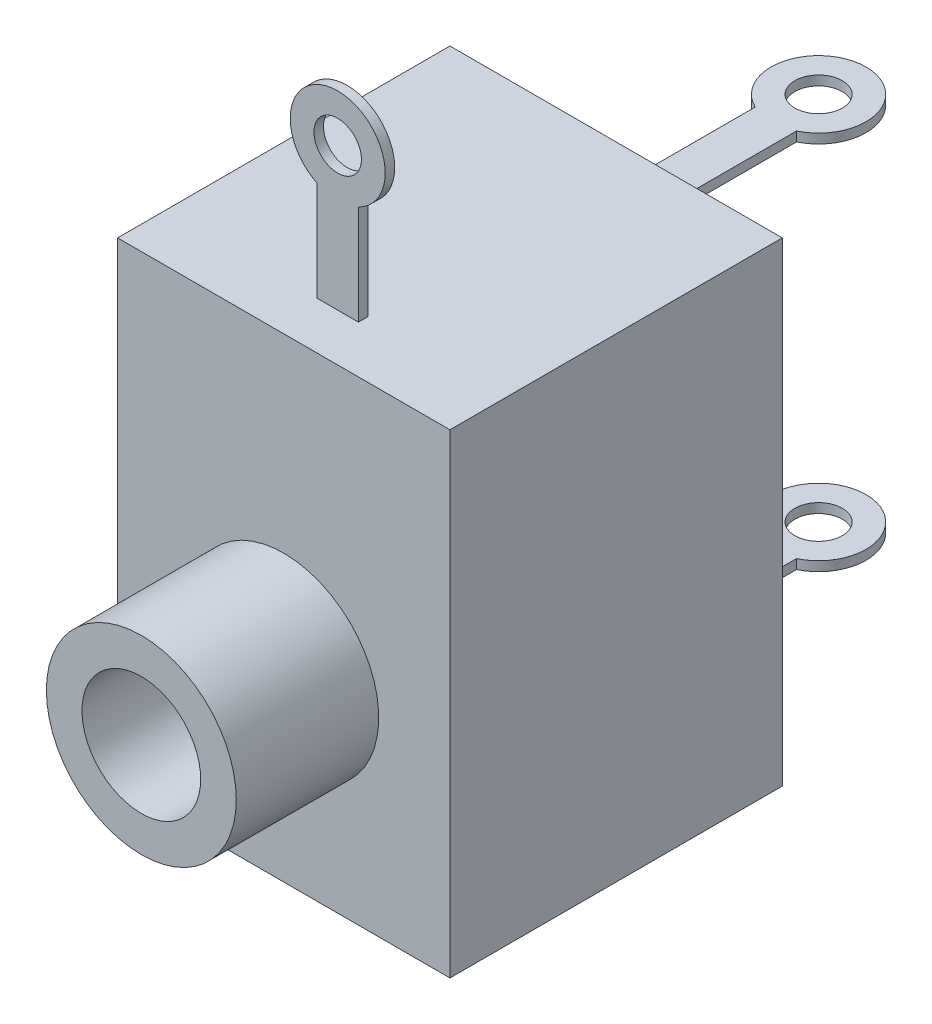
from build123d import *

# Parameters (mm, degrees)
ESQUISSE1_W             = 7
ESQUISSE1_H             = 10
EXTRUSION1_DEPTH        = 7
COQUE1_T                = -1
ESQUISSE2_R             = 2
EXTRUSION2_DEPTH        = 3
ESQUISSE3_R             = 1.25
ENL_V_MAT_EXTRU_1_DEPTH = 16.779733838
ESQUISSE4_R             = 0.5
EXTRUSION3_DEPTH        = 0.2
ESQUISSE6_R             = 0.5
EXTRUSION5_DEPTH        = 0.2
ESQUISSE7_R             = 0.5
EXTRUSION6_DEPTH        = 0.2


with BuildPart() as part:
    # Esquisse1 → Extrusion1 (new body)
    with BuildSketch(Plane.XY):
        with Locations((3.5, 5)):
            Rectangle(ESQUISSE1_W, ESQUISSE1_H)
    extrude(amount=EXTRUSION1_DEPTH)

    # Coque1
    coque1_openings = [part.faces().sort_by_distance(p)[0] for p in [
        (3.5, 5, 0),
    ]]
    offset(amount=COQUE1_T, openings=coque1_openings, kind=Kind.INTERSECTION)

    # Esquisse2 → Extrusion2 (add)
    with BuildSketch(Plane.XY.offset(7)):
        with Locations(Location((3.5, 4, 0), (0, 0, 180))):
            Circle(ESQUISSE2_R)
    extrude(amount=EXTRUSION2_DEPTH)

    # Esquisse3 → Enl_v. mat.-Extru.1 (cut, through all)
    with BuildSketch(Plane.XY.offset(10)):
        with Locations((3.5, 4)):
            Circle(ESQUISSE3_R)
    extrude(amount=-ENL_V_MAT_EXTRU_1_DEPTH, mode=Mode.SUBTRACT)

    # Esquisse7 → Extrusion6 (add)
    with BuildSketch(Plane(origin=(0, 0, 6), x_dir=(-1, 0, 0), z_dir=(0, 0, -1))):
        with BuildLine():
            Line((-4.071836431, 9), (-3.200056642, 9))
            Line((-3.200056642, 9), (-3.200056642, 12.1))
            ThreePointArc((-3.200056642, 12.1), (-3.635946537, 14), (-4.071836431, 12.1))
            Line((-4.071836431, 12.1), (-4.071836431, 9))
        make_face()
        with Locations((-3.635946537, 13)):
            Circle(ESQUISSE7_R, mode=Mode.SUBTRACT)
    extrude(amount=EXTRUSION6_DEPTH)


with BuildPart() as body_2:
    # Esquisse4 → Extrusion3 (new body)
    with BuildSketch(Plane.XZ.offset(-9)):
        with BuildLine():
            Line((4.2, 0), (3.328220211, 0))
            Line((3.328220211, 0), (3.328220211, -3.1))
            ThreePointArc((3.328220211, -3.1), (3.764110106, -5), (4.2, -3.1))
            Line((4.2, -3.1), (4.2, 0))
        make_face()
        with Locations((3.764110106, -4)):
            Circle(ESQUISSE4_R, mode=Mode.SUBTRACT)
    extrude(amount=EXTRUSION3_DEPTH)


with BuildPart() as body_3:
    # Esquisse6 → Extrusion5 (new body)
    with BuildSketch(Plane(origin=(0, 1, 0), x_dir=(1, 0, 0), z_dir=(0, 1, 0))):
        with BuildLine():
            Line((4.2, 0), (3.328220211, 0))
            Line((3.328220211, 0), (3.328220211, 3.1))
            ThreePointArc((3.328220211, 3.1), (3.764110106, 5), (4.2, 3.1))
            Line((4.2, 3.1), (4.2, 0))
        make_face()
        with Locations(Location((3.764110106, 4, 0), (0, 0, 270))):
            Circle(ESQUISSE6_R, mode=Mode.SUBTRACT)
    extrude(amount=EXTRUSION5_DEPTH)


solid = Compound([part.part, body_2.part, body_3.part])
